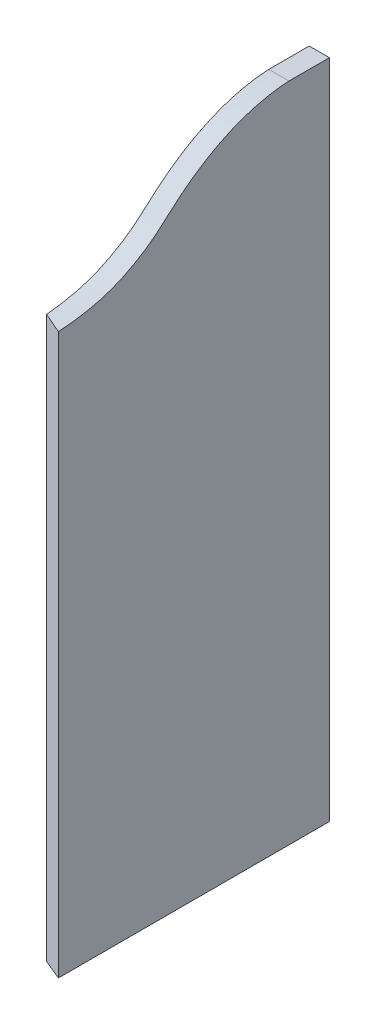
ISO-10303-21;
HEADER;
FILE_DESCRIPTION(('STEP AP214'),'2;1');
FILE_NAME('part.step','',(''),(''),'','','');
FILE_SCHEMA(('AUTOMOTIVE_DESIGN { 1 0 10303 214 1 1 1 1 }'));
ENDSEC;
DATA;
#1=APPLICATION_CONTEXT('core data for automotive mechanical design processes');
#2=APPLICATION_PROTOCOL_DEFINITION('international standard','automotive_design',2000,#1);
#3=PRODUCT_CONTEXT('',#1,'mechanical');
#4=PRODUCT('Part','Part','',(#3));
#5=PRODUCT_RELATED_PRODUCT_CATEGORY('part','',(#4));
#6=PRODUCT_DEFINITION_FORMATION('','',#4);
#7=PRODUCT_DEFINITION_CONTEXT('part definition',#1,'design');
#8=PRODUCT_DEFINITION('design','',#6,#7);
#9=PRODUCT_DEFINITION_SHAPE('','',#8);
#10=(LENGTH_UNIT() NAMED_UNIT(*) SI_UNIT(.MILLI.,.METRE.));
#11=(NAMED_UNIT(*) PLANE_ANGLE_UNIT() SI_UNIT($,.RADIAN.));
#12=(NAMED_UNIT(*) SI_UNIT($,.STERADIAN.) SOLID_ANGLE_UNIT());
#13=UNCERTAINTY_MEASURE_WITH_UNIT(LENGTH_MEASURE(1.E-05),#10,'distance_accuracy_value','');
#14=(GEOMETRIC_REPRESENTATION_CONTEXT(3) GLOBAL_UNCERTAINTY_ASSIGNED_CONTEXT((#13)) GLOBAL_UNIT_ASSIGNED_CONTEXT((#10,
#11,#12)) REPRESENTATION_CONTEXT('',''));
#15=CARTESIAN_POINT('',(0.,0.,0.));
#16=DIRECTION('',(0.,0.,1.));
#17=DIRECTION('',(1.,0.,0.));
#18=AXIS2_PLACEMENT_3D('',#15,#16,#17);
#19=CARTESIAN_POINT('',(1219.2,831.85,-1193.8));
#20=DIRECTION('',(-1.,0.,0.));
#21=DIRECTION('',(0.,0.,1.));
#22=AXIS2_PLACEMENT_3D('',#19,#20,#21);
#23=PLANE('',#22);
#24=DIRECTION('',(0.,0.,-1.));
#25=VECTOR('',#24,1.);
#26=CARTESIAN_POINT('',(1219.2,831.85,-1193.8));
#27=LINE('',#26,#25);
#28=CARTESIAN_POINT('',(1219.2,831.85,-1143.));
#29=VERTEX_POINT('',#28);
#30=CARTESIAN_POINT('',(1219.2,831.85,-1193.8));
#31=VERTEX_POINT('',#30);
#32=EDGE_CURVE('E93',#29,#31,#27,.T.);
#33=ORIENTED_EDGE('',*,*,#32,.F.);
#34=CARTESIAN_POINT('',(1219.2,703.815722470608,-853.078975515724));
#35=CARTESIAN_POINT('',(1219.2,705.657404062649,-877.816830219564));
#36=CARTESIAN_POINT('',(1219.2,710.307913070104,-911.486934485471));
#37=CARTESIAN_POINT('',(1219.2,745.894569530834,-978.590793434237));
#38=CARTESIAN_POINT('',(1219.2,773.921699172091,-995.38741411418));
#39=CARTESIAN_POINT('',(1219.2,828.845673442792,-1085.87322373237));
#40=CARTESIAN_POINT('',(1219.2,831.85,-1143.));
#41=B_SPLINE_CURVE_WITH_KNOTS('',3,(#34,#35,#36,#37,#38,#39,#40),.UNSPECIFIED.,.F.,.F.,(4,1,1,1,
4),(0.,0.275879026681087,0.343470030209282,0.675910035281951,1.),.UNSPECIFIED.);
#42=CARTESIAN_POINT('',(1219.2,703.815722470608,-853.078975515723));
#43=VERTEX_POINT('',#42);
#44=EDGE_CURVE('E46',#43,#29,#41,.T.);
#45=ORIENTED_EDGE('',*,*,#44,.F.);
#46=DIRECTION('',(0.,-1.,0.));
#47=VECTOR('',#46,1.);
#48=CARTESIAN_POINT('',(1219.2,831.85,-853.078975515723));
#49=LINE('',#48,#47);
#50=CARTESIAN_POINT('',(1219.2,0.,-853.078975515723));
#51=VERTEX_POINT('',#50);
#52=EDGE_CURVE('E74',#43,#51,#49,.T.);
#53=ORIENTED_EDGE('',*,*,#52,.T.);
#54=DIRECTION('',(0.,0.,-1.));
#55=VECTOR('',#54,1.);
#56=CARTESIAN_POINT('',(1219.2,0.,-1193.8));
#57=LINE('',#56,#55);
#58=CARTESIAN_POINT('',(1219.2,0.,-1193.8));
#59=VERTEX_POINT('',#58);
#60=EDGE_CURVE('E79',#51,#59,#57,.T.);
#61=ORIENTED_EDGE('',*,*,#60,.T.);
#62=DIRECTION('',(0.,-1.,0.));
#63=VECTOR('',#62,1.);
#64=CARTESIAN_POINT('',(1219.2,831.85,-1193.8));
#65=LINE('',#64,#63);
#66=EDGE_CURVE('E11',#31,#59,#65,.T.);
#67=ORIENTED_EDGE('',*,*,#66,.F.);
#68=EDGE_LOOP('',(#33,#45,#53,#61,#67));
#69=FACE_BOUND('',#68,.T.);
#70=ADVANCED_FACE('F32',(#69),#23,.F.);
#71=CARTESIAN_POINT('',(1219.2,831.85,-1193.8));
#72=DIRECTION('',(0.,0.,1.));
#73=DIRECTION('',(1.,0.,0.));
#74=AXIS2_PLACEMENT_3D('',#71,#72,#73);
#75=PLANE('',#74);
#76=DIRECTION('',(-1.,0.,0.));
#77=VECTOR('',#76,1.);
#78=CARTESIAN_POINT('',(1219.2,0.,-1193.8));
#79=LINE('',#78,#77);
#80=CARTESIAN_POINT('',(1193.8,0.,-1193.8));
#81=VERTEX_POINT('',#80);
#82=EDGE_CURVE('E97',#59,#81,#79,.T.);
#83=ORIENTED_EDGE('',*,*,#82,.T.);
#84=DIRECTION('',(0.,-1.,0.));
#85=VECTOR('',#84,1.);
#86=CARTESIAN_POINT('',(1193.8,831.85,-1193.8));
#87=LINE('',#86,#85);
#88=CARTESIAN_POINT('',(1193.8,831.85,-1193.8));
#89=VERTEX_POINT('',#88);
#90=EDGE_CURVE('E39',#89,#81,#87,.T.);
#91=ORIENTED_EDGE('',*,*,#90,.F.);
#92=DIRECTION('',(-1.,0.,0.));
#93=VECTOR('',#92,1.);
#94=CARTESIAN_POINT('',(1219.2,831.85,-1193.8));
#95=LINE('',#94,#93);
#96=EDGE_CURVE('E55',#31,#89,#95,.T.);
#97=ORIENTED_EDGE('',*,*,#96,.F.);
#98=ORIENTED_EDGE('',*,*,#66,.T.);
#99=EDGE_LOOP('',(#83,#91,#97,#98));
#100=FACE_BOUND('',#99,.T.);
#101=ADVANCED_FACE('F113',(#100),#75,.F.);
#102=CARTESIAN_POINT('',(1193.8,831.85,-1193.8));
#103=DIRECTION('',(1.,0.,0.));
#104=DIRECTION('',(0.,0.,-1.));
#105=AXIS2_PLACEMENT_3D('',#102,#103,#104);
#106=PLANE('',#105);
#107=DIRECTION('',(0.,-1.,0.));
#108=VECTOR('',#107,1.);
#109=CARTESIAN_POINT('',(1193.8,831.85,-863.6));
#110=LINE('',#109,#108);
#111=CARTESIAN_POINT('',(1193.8,704.71926711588,-863.599999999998));
#112=VERTEX_POINT('',#111);
#113=CARTESIAN_POINT('',(1193.8,0.,-863.6));
#114=VERTEX_POINT('',#113);
#115=EDGE_CURVE('E83',#112,#114,#110,.T.);
#116=ORIENTED_EDGE('',*,*,#115,.F.);
#117=CARTESIAN_POINT('',(1193.8,703.815722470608,-853.078975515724));
#118=CARTESIAN_POINT('',(1193.8,705.657404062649,-877.816830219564));
#119=CARTESIAN_POINT('',(1193.8,710.307913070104,-911.486934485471));
#120=CARTESIAN_POINT('',(1193.8,745.894569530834,-978.590793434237));
#121=CARTESIAN_POINT('',(1193.8,773.921699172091,-995.38741411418));
#122=CARTESIAN_POINT('',(1193.8,828.845673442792,-1085.87322373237));
#123=CARTESIAN_POINT('',(1193.8,831.85,-1143.));
#124=B_SPLINE_CURVE_WITH_KNOTS('',3,(#117,#118,#119,#120,#121,#122,#123),.UNSPECIFIED.,.F.,.F.,
(4,1,1,1,4),(0.,0.275879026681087,0.343470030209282,0.675910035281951,1.),.UNSPECIFIED.);
#125=CARTESIAN_POINT('',(1193.8,831.85,-1143.));
#126=VERTEX_POINT('',#125);
#127=EDGE_CURVE('E131',#112,#126,#124,.T.);
#128=ORIENTED_EDGE('',*,*,#127,.T.);
#129=DIRECTION('',(0.,0.,1.));
#130=VECTOR('',#129,1.);
#131=CARTESIAN_POINT('',(1193.8,831.85,-1193.8));
#132=LINE('',#131,#130);
#133=EDGE_CURVE('E84',#89,#126,#132,.T.);
#134=ORIENTED_EDGE('',*,*,#133,.F.);
#135=ORIENTED_EDGE('',*,*,#90,.T.);
#136=DIRECTION('',(0.,0.,1.));
#137=VECTOR('',#136,1.);
#138=CARTESIAN_POINT('',(1193.8,0.,-1193.8));
#139=LINE('',#138,#137);
#140=EDGE_CURVE('E94',#81,#114,#139,.T.);
#141=ORIENTED_EDGE('',*,*,#140,.T.);
#142=EDGE_LOOP('',(#116,#128,#134,#135,#141));
#143=FACE_BOUND('',#142,.T.);
#144=ADVANCED_FACE('F110',(#143),#106,.F.);
#145=CARTESIAN_POINT('',(1219.2,831.85,-853.078975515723));
#146=DIRECTION('',(0.382683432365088,0.,-0.923879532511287));
#147=DIRECTION('',(-0.923879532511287,0.,-0.382683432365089));
#148=AXIS2_PLACEMENT_3D('',#145,#146,#147);
#149=PLANE('',#148);
#150=ORIENTED_EDGE('',*,*,#52,.F.);
#151=CARTESIAN_POINT('',(1219.2,703.815722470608,-853.078975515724));
#152=CARTESIAN_POINT('',(1218.14151626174,703.84836309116,-853.517413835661));
#153=CARTESIAN_POINT('',(1217.0830466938,703.881544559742,-853.955846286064));
#154=CARTESIAN_POINT('',(1214.96614277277,703.949053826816,-854.832696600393));
#155=CARTESIAN_POINT('',(1213.90770841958,703.983381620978,-855.271114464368));
#156=CARTESIAN_POINT('',(1211.79087671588,704.053248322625,-856.147934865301));
#157=CARTESIAN_POINT('',(1210.73247936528,704.08878722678,-856.586337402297));
#158=CARTESIAN_POINT('',(1208.61572346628,704.161139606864,-857.463126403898));
#159=CARTESIAN_POINT('',(1207.55736491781,704.197953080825,-857.901512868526));
#160=CARTESIAN_POINT('',(1205.4406877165,704.272917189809,-858.778269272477));
#161=CARTESIAN_POINT('',(1204.38236906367,704.311067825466,-859.216639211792));
#162=CARTESIAN_POINT('',(1202.26577433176,704.388767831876,-860.093361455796));
#163=CARTESIAN_POINT('',(1201.20749825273,704.428317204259,-860.531713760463));
#164=CARTESIAN_POINT('',(1199.09099063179,704.508875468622,-861.408399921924));
#165=CARTESIAN_POINT('',(1198.03275909,704.549884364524,-861.846733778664));
#166=CARTESIAN_POINT('',(1195.91634253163,704.633421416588,-862.723382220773));
#167=CARTESIAN_POINT('',(1194.85815751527,704.675949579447,-863.161696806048));
#168=CARTESIAN_POINT('',(1193.8,704.719267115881,-863.600000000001));
#169=B_SPLINE_CURVE_WITH_KNOTS('',3,(#151,#152,#153,#154,#155,#156,#157,#158,#159,#160,#161,
#162,#163,#164,#165,#166,#167,#168),.UNSPECIFIED.,.F.,.F.,(4,2,2,2,2,2,2,2,4),(0.,
3.43847820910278,6.87694343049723,10.3153991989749,13.753849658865,17.1923017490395,
20.630757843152,24.0692231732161,27.5077036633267),.UNSPECIFIED.);
#170=EDGE_CURVE('E98',#43,#112,#169,.T.);
#171=ORIENTED_EDGE('',*,*,#170,.T.);
#172=ORIENTED_EDGE('',*,*,#115,.T.);
#173=DIRECTION('',(0.923879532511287,0.,0.382683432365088));
#174=VECTOR('',#173,1.);
#175=CARTESIAN_POINT('',(1219.2,0.,-853.078975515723));
#176=LINE('',#175,#174);
#177=EDGE_CURVE('E87',#114,#51,#176,.T.);
#178=ORIENTED_EDGE('',*,*,#177,.T.);
#179=EDGE_LOOP('',(#150,#171,#172,#178));
#180=FACE_BOUND('',#179,.T.);
#181=ADVANCED_FACE('F88',(#180),#149,.F.);
#182=CARTESIAN_POINT('',(0.,831.85,0.));
#183=DIRECTION('',(0.,-1.,0.));
#184=DIRECTION('',(0.,0.,-1.));
#185=AXIS2_PLACEMENT_3D('',#182,#183,#184);
#186=PLANE('',#185);
#187=ORIENTED_EDGE('',*,*,#133,.T.);
#188=DIRECTION('',(1.,0.,0.));
#189=VECTOR('',#188,1.);
#190=CARTESIAN_POINT('',(1193.8,831.85,-1143.));
#191=LINE('',#190,#189);
#192=EDGE_CURVE('E101',#126,#29,#191,.T.);
#193=ORIENTED_EDGE('',*,*,#192,.T.);
#194=ORIENTED_EDGE('',*,*,#32,.T.);
#195=ORIENTED_EDGE('',*,*,#96,.T.);
#196=EDGE_LOOP('',(#187,#193,#194,#195));
#197=FACE_BOUND('',#196,.T.);
#198=ADVANCED_FACE('F130',(#197),#186,.F.);
#199=CARTESIAN_POINT('',(0.,0.,0.));
#200=DIRECTION('',(0.,-1.,0.));
#201=DIRECTION('',(0.,0.,-1.));
#202=AXIS2_PLACEMENT_3D('',#199,#200,#201);
#203=PLANE('',#202);
#204=ORIENTED_EDGE('',*,*,#60,.F.);
#205=ORIENTED_EDGE('',*,*,#177,.F.);
#206=ORIENTED_EDGE('',*,*,#140,.F.);
#207=ORIENTED_EDGE('',*,*,#82,.F.);
#208=EDGE_LOOP('',(#204,#205,#206,#207));
#209=FACE_BOUND('',#208,.T.);
#210=ADVANCED_FACE('F96',(#209),#203,.T.);
#211=DIRECTION('',(1.,0.,0.));
#212=VECTOR('',#211,1.);
#213=SURFACE_OF_LINEAR_EXTRUSION('',#124,#212);
#214=ORIENTED_EDGE('',*,*,#44,.T.);
#215=ORIENTED_EDGE('',*,*,#192,.F.);
#216=ORIENTED_EDGE('',*,*,#127,.F.);
#217=ORIENTED_EDGE('',*,*,#170,.F.);
#218=EDGE_LOOP('',(#214,#215,#216,#217));
#219=FACE_BOUND('',#218,.T.);
#220=ADVANCED_FACE('F125',(#219),#213,.F.);
#221=CLOSED_SHELL('',(#70,#101,#144,#181,#198,#210,#220));
#222=MANIFOLD_SOLID_BREP('B2',#221);
#223=ADVANCED_BREP_SHAPE_REPRESENTATION('',(#18,#222),#14);
#224=SHAPE_DEFINITION_REPRESENTATION(#9,#223);
ENDSEC;
END-ISO-10303-21;
